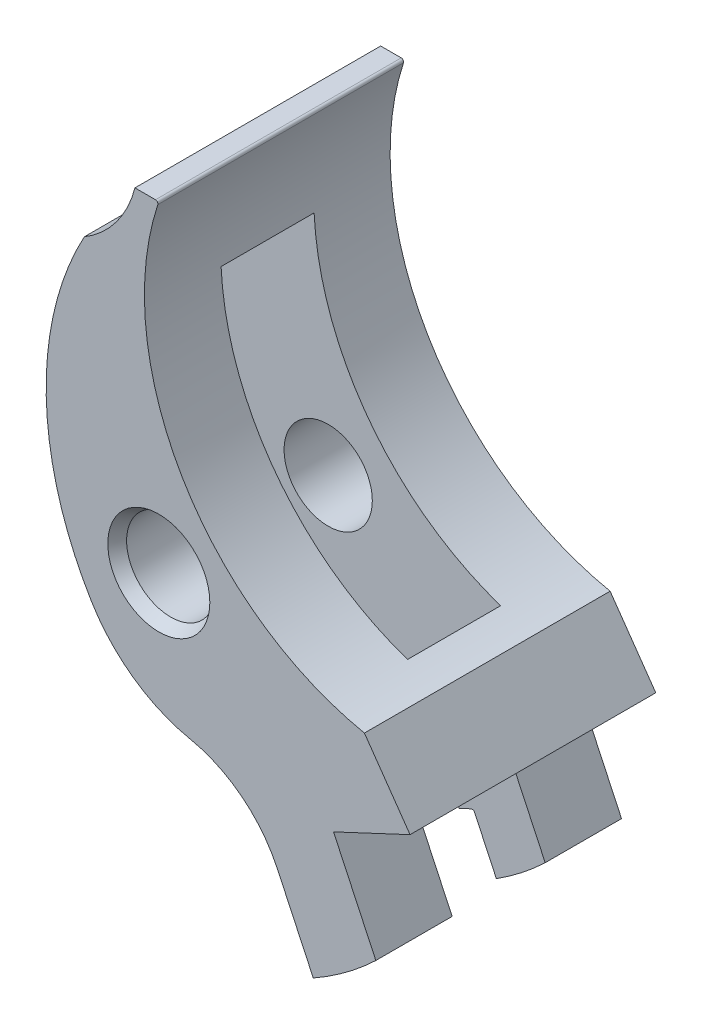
ISO-10303-21;
HEADER;
FILE_DESCRIPTION(('STEP AP214'),'2;1');
FILE_NAME('part.step','',(''),(''),'','','');
FILE_SCHEMA(('AUTOMOTIVE_DESIGN { 1 0 10303 214 1 1 1 1 }'));
ENDSEC;
DATA;
#1=APPLICATION_CONTEXT('core data for automotive mechanical design processes');
#2=APPLICATION_PROTOCOL_DEFINITION('international standard','automotive_design',2000,#1);
#3=PRODUCT_CONTEXT('',#1,'mechanical');
#4=PRODUCT('Part','Part','',(#3));
#5=PRODUCT_RELATED_PRODUCT_CATEGORY('part','',(#4));
#6=PRODUCT_DEFINITION_FORMATION('','',#4);
#7=PRODUCT_DEFINITION_CONTEXT('part definition',#1,'design');
#8=PRODUCT_DEFINITION('design','',#6,#7);
#9=PRODUCT_DEFINITION_SHAPE('','',#8);
#10=(LENGTH_UNIT() NAMED_UNIT(*) SI_UNIT(.MILLI.,.METRE.));
#11=(NAMED_UNIT(*) PLANE_ANGLE_UNIT() SI_UNIT($,.RADIAN.));
#12=(NAMED_UNIT(*) SI_UNIT($,.STERADIAN.) SOLID_ANGLE_UNIT());
#13=UNCERTAINTY_MEASURE_WITH_UNIT(LENGTH_MEASURE(1.E-05),#10,'distance_accuracy_value','');
#14=(GEOMETRIC_REPRESENTATION_CONTEXT(3) GLOBAL_UNCERTAINTY_ASSIGNED_CONTEXT((#13)) GLOBAL_UNIT_ASSIGNED_CONTEXT((#10,
#11,#12)) REPRESENTATION_CONTEXT('',''));
#15=CARTESIAN_POINT('',(0.,0.,0.));
#16=DIRECTION('',(0.,0.,1.));
#17=DIRECTION('',(1.,0.,0.));
#18=AXIS2_PLACEMENT_3D('',#15,#16,#17);
#19=CARTESIAN_POINT('',(0.,0.,3.9243));
#20=DIRECTION('',(0.,0.,1.));
#21=DIRECTION('',(1.,0.,0.));
#22=AXIS2_PLACEMENT_3D('',#19,#20,#21);
#23=PLANE('',#22);
#24=CARTESIAN_POINT('',(8.3281696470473,7.4676,3.9243));
#25=DIRECTION('',(0.,0.,-1.));
#26=DIRECTION('',(-1.,0.,0.));
#27=AXIS2_PLACEMENT_3D('',#24,#25,#26);
#28=CIRCLE('',#27,8.7884);
#29=CARTESIAN_POINT('',(6.56750446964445,-1.14262837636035,3.9243));
#30=VERTEX_POINT('',#29);
#31=CARTESIAN_POINT('',(-0.0329289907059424,10.1746286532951,3.9243));
#32=VERTEX_POINT('',#31);
#33=EDGE_CURVE('E435',#30,#32,#28,.T.);
#34=ORIENTED_EDGE('',*,*,#33,.T.);
#35=CARTESIAN_POINT('',(-0.105424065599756,10.1981,3.9243));
#36=DIRECTION('',(0.,0.,1.));
#37=DIRECTION('',(1.,0.,0.));
#38=AXIS2_PLACEMENT_3D('',#35,#36,#37);
#39=CIRCLE('',#38,0.0762);
#40=CARTESIAN_POINT('',(-0.105424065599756,10.2743,3.9243));
#41=VERTEX_POINT('',#40);
#42=EDGE_CURVE('E315',#32,#41,#39,.T.);
#43=ORIENTED_EDGE('',*,*,#42,.T.);
#44=DIRECTION('',(-1.,0.,0.));
#45=VECTOR('',#44,1.);
#46=CARTESIAN_POINT('',(0.,10.2743,3.9243));
#47=LINE('',#46,#45);
#48=CARTESIAN_POINT('',(-0.762,10.2743,3.9243));
#49=VERTEX_POINT('',#48);
#50=EDGE_CURVE('E438',#41,#49,#47,.T.);
#51=ORIENTED_EDGE('',*,*,#50,.T.);
#52=CARTESIAN_POINT('',(-4.20508219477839,11.1633,3.9243));
#53=DIRECTION('',(0.,0.,-1.));
#54=DIRECTION('',(-1.,0.,0.));
#55=AXIS2_PLACEMENT_3D('',#52,#53,#54);
#56=CIRCLE('',#55,3.556);
#57=CARTESIAN_POINT('',(-2.38002210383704,8.11136755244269,3.9243));
#58=VERTEX_POINT('',#57);
#59=EDGE_CURVE('E440',#49,#58,#56,.T.);
#60=ORIENTED_EDGE('',*,*,#59,.T.);
#61=CARTESIAN_POINT('',(6.40850243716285,3.32452160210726,3.9243));
#62=DIRECTION('',(0.,0.,1.));
#63=DIRECTION('',(1.,0.,0.));
#64=AXIS2_PLACEMENT_3D('',#61,#62,#63);
#65=CIRCLE('',#64,10.0076);
#66=CARTESIAN_POINT('',(-2.1433966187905,-1.87327411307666,3.9243));
#67=VERTEX_POINT('',#66);
#68=EDGE_CURVE('E442',#58,#67,#65,.T.);
#69=ORIENTED_EDGE('',*,*,#68,.T.);
#70=CARTESIAN_POINT('',(1.98061561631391,0.63327712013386,3.9243));
#71=DIRECTION('',(0.,0.,1.));
#72=DIRECTION('',(1.,0.,0.));
#73=AXIS2_PLACEMENT_3D('',#70,#71,#72);
#74=CIRCLE('',#73,4.826);
#75=CARTESIAN_POINT('',(1.00319933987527,-4.09270779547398,3.9243));
#76=VERTEX_POINT('',#75);
#77=EDGE_CURVE('E444',#67,#76,#74,.T.);
#78=ORIENTED_EDGE('',*,*,#77,.T.);
#79=CARTESIAN_POINT('',(0.200689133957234,-7.9729901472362,3.9243));
#80=DIRECTION('',(0.,0.,-1.));
#81=DIRECTION('',(-1.,0.,0.));
#82=AXIS2_PLACEMENT_3D('',#79,#80,#81);
#83=CIRCLE('',#82,3.9624);
#84=CARTESIAN_POINT('',(3.78891494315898,-6.29214235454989,3.9243));
#85=VERTEX_POINT('',#84);
#86=EDGE_CURVE('E247',#76,#85,#83,.T.);
#87=ORIENTED_EDGE('',*,*,#86,.T.);
#88=DIRECTION('',(0.424199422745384,-0.905568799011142,0.));
#89=VECTOR('',#88,1.);
#90=CARTESIAN_POINT('',(4.93374354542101,-8.73608972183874,3.9243));
#91=LINE('',#90,#89);
#92=CARTESIAN_POINT('',(4.93374354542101,-8.73608972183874,3.9243));
#93=VERTEX_POINT('',#92);
#94=EDGE_CURVE('E243',#85,#93,#91,.T.);
#95=ORIENTED_EDGE('',*,*,#94,.T.);
#96=CARTESIAN_POINT('',(0.,0.,3.9243));
#97=DIRECTION('',(0.,0.,1.));
#98=DIRECTION('',(1.,0.,0.));
#99=AXIS2_PLACEMENT_3D('',#96,#97,#98);
#100=CIRCLE('',#99,10.033);
#101=CARTESIAN_POINT('',(6.93183776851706,-7.25332435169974,3.9243));
#102=VERTEX_POINT('',#101);
#103=EDGE_CURVE('E426',#93,#102,#100,.T.);
#104=ORIENTED_EDGE('',*,*,#103,.T.);
#105=DIRECTION('',(-0.424199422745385,0.905568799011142,0.));
#106=VECTOR('',#105,1.);
#107=CARTESIAN_POINT('',(6.93183776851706,-7.25332435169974,3.9243));
#108=LINE('',#107,#106);
#109=CARTESIAN_POINT('',(5.58107405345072,-4.36975259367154,3.9243));
#110=VERTEX_POINT('',#109);
#111=EDGE_CURVE('E429',#102,#110,#108,.T.);
#112=ORIENTED_EDGE('',*,*,#111,.T.);
#113=DIRECTION('',(0.905568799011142,0.424199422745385,0.));
#114=VECTOR('',#113,1.);
#115=CARTESIAN_POINT('',(5.58107405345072,-4.36975259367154,3.9243));
#116=LINE('',#115,#114);
#117=CARTESIAN_POINT('',(8.02541459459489,-3.22473981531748,3.9243));
#118=VERTEX_POINT('',#117);
#119=EDGE_CURVE('E431',#110,#118,#116,.T.);
#120=ORIENTED_EDGE('',*,*,#119,.T.);
#121=DIRECTION('',(-0.573576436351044,0.819152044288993,0.));
#122=VECTOR('',#121,1.);
#123=CARTESIAN_POINT('',(8.02541459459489,-3.22473981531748,3.9243));
#124=LINE('',#123,#122);
#125=EDGE_CURVE('E433',#118,#30,#124,.T.);
#126=ORIENTED_EDGE('',*,*,#125,.T.);
#127=EDGE_LOOP('',(#34,#43,#51,#60,#69,#78,#87,#95,#104,#112,#120,#126));
#128=FACE_BOUND('',#127,.T.);
#129=CARTESIAN_POINT('',(0.,0.,3.9243));
#130=DIRECTION('',(0.,0.,1.));
#131=DIRECTION('',(1.,0.,0.));
#132=AXIS2_PLACEMENT_3D('',#129,#130,#131);
#133=CIRCLE('',#132,1.62967045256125);
#134=CARTESIAN_POINT('',(1.62967045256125,0.,3.9243));
#135=VERTEX_POINT('',#134);
#136=EDGE_CURVE('E298',#135,#135,#133,.T.);
#137=ORIENTED_EDGE('',*,*,#136,.F.);
#138=EDGE_LOOP('',(#137));
#139=FACE_BOUND('',#138,.T.);
#140=ADVANCED_FACE('F32',(#128,#139),#23,.T.);
#141=CARTESIAN_POINT('',(0.,0.,3.9243));
#142=DIRECTION('',(0.,0.,-1.));
#143=DIRECTION('',(-1.,0.,0.));
#144=AXIS2_PLACEMENT_3D('',#141,#142,#143);
#145=CYLINDRICAL_SURFACE('',#144,1.4097);
#146=CARTESIAN_POINT('',(0.,0.,1.4859));
#147=DIRECTION('',(0.,0.,1.));
#148=DIRECTION('',(1.,0.,0.));
#149=AXIS2_PLACEMENT_3D('',#146,#147,#148);
#150=CIRCLE('',#149,1.4097);
#151=CARTESIAN_POINT('',(1.4097,0.,1.4859));
#152=VERTEX_POINT('',#151);
#153=EDGE_CURVE('E284',#152,#152,#150,.T.);
#154=ORIENTED_EDGE('',*,*,#153,.F.);
#155=EDGE_LOOP('',(#154));
#156=FACE_BOUND('',#155,.T.);
#157=CARTESIAN_POINT('',(0.,0.,3.5433));
#158=DIRECTION('',(0.,0.,1.));
#159=DIRECTION('',(1.,0.,0.));
#160=AXIS2_PLACEMENT_3D('',#157,#158,#159);
#161=CIRCLE('',#160,1.4097);
#162=CARTESIAN_POINT('',(1.4097,0.,3.5433));
#163=VERTEX_POINT('',#162);
#164=EDGE_CURVE('E294',#163,#163,#161,.T.);
#165=ORIENTED_EDGE('',*,*,#164,.T.);
#166=EDGE_LOOP('',(#165));
#167=FACE_BOUND('',#166,.T.);
#168=ADVANCED_FACE('F573',(#156,#167),#145,.F.);
#169=CARTESIAN_POINT('',(0.,0.,-1.4859));
#170=DIRECTION('',(0.,0.,1.));
#171=DIRECTION('',(1.,0.,0.));
#172=AXIS2_PLACEMENT_3D('',#169,#170,#171);
#173=CIRCLE('',#172,1.4097);
#174=CARTESIAN_POINT('',(1.4097,0.,-1.4859));
#175=VERTEX_POINT('',#174);
#176=EDGE_CURVE('E289',#175,#175,#173,.T.);
#177=ORIENTED_EDGE('',*,*,#176,.T.);
#178=EDGE_LOOP('',(#177));
#179=FACE_BOUND('',#178,.T.);
#180=CARTESIAN_POINT('',(0.,0.,-3.5433));
#181=DIRECTION('',(0.,0.,-1.));
#182=DIRECTION('',(-1.,0.,0.));
#183=AXIS2_PLACEMENT_3D('',#180,#181,#182);
#184=CIRCLE('',#183,1.4097);
#185=CARTESIAN_POINT('',(-1.4097,0.,-3.5433));
#186=VERTEX_POINT('',#185);
#187=EDGE_CURVE('E361',#186,#186,#184,.T.);
#188=ORIENTED_EDGE('',*,*,#187,.T.);
#189=EDGE_LOOP('',(#188));
#190=FACE_BOUND('',#189,.T.);
#191=ADVANCED_FACE('F578',(#179,#190),#145,.F.);
#192=CARTESIAN_POINT('',(0.,0.,-3.9243));
#193=DIRECTION('',(0.,0.,1.));
#194=DIRECTION('',(1.,0.,0.));
#195=AXIS2_PLACEMENT_3D('',#192,#193,#194);
#196=PLANE('',#195);
#197=DIRECTION('',(-1.,0.,0.));
#198=VECTOR('',#197,1.);
#199=CARTESIAN_POINT('',(0.,10.2743,-3.9243));
#200=LINE('',#199,#198);
#201=CARTESIAN_POINT('',(-0.105424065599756,10.2743,-3.9243));
#202=VERTEX_POINT('',#201);
#203=CARTESIAN_POINT('',(-0.762,10.2743,-3.9243));
#204=VERTEX_POINT('',#203);
#205=EDGE_CURVE('E458',#202,#204,#200,.T.);
#206=ORIENTED_EDGE('',*,*,#205,.F.);
#207=CARTESIAN_POINT('',(-0.105424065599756,10.1981,-3.9243));
#208=DIRECTION('',(0.,0.,1.));
#209=DIRECTION('',(1.,0.,0.));
#210=AXIS2_PLACEMENT_3D('',#207,#208,#209);
#211=CIRCLE('',#210,0.0762);
#212=CARTESIAN_POINT('',(-0.0329289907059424,10.1746286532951,-3.9243));
#213=VERTEX_POINT('',#212);
#214=EDGE_CURVE('E311',#202,#213,#211,.F.);
#215=ORIENTED_EDGE('',*,*,#214,.T.);
#216=CARTESIAN_POINT('',(8.3281696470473,7.4676,-3.9243));
#217=DIRECTION('',(0.,0.,-1.));
#218=DIRECTION('',(-1.,0.,0.));
#219=AXIS2_PLACEMENT_3D('',#216,#217,#218);
#220=CIRCLE('',#219,8.7884);
#221=CARTESIAN_POINT('',(6.56750446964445,-1.14262837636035,-3.9243));
#222=VERTEX_POINT('',#221);
#223=EDGE_CURVE('E455',#222,#213,#220,.T.);
#224=ORIENTED_EDGE('',*,*,#223,.F.);
#225=DIRECTION('',(-0.573576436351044,0.819152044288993,0.));
#226=VECTOR('',#225,1.);
#227=CARTESIAN_POINT('',(8.02541459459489,-3.22473981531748,-3.9243));
#228=LINE('',#227,#226);
#229=CARTESIAN_POINT('',(8.02541459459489,-3.22473981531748,-3.9243));
#230=VERTEX_POINT('',#229);
#231=EDGE_CURVE('E453',#230,#222,#228,.T.);
#232=ORIENTED_EDGE('',*,*,#231,.F.);
#233=DIRECTION('',(0.905568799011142,0.424199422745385,0.));
#234=VECTOR('',#233,1.);
#235=CARTESIAN_POINT('',(5.58107405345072,-4.36975259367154,-3.9243));
#236=LINE('',#235,#234);
#237=CARTESIAN_POINT('',(5.58107405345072,-4.36975259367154,-3.9243));
#238=VERTEX_POINT('',#237);
#239=EDGE_CURVE('E451',#238,#230,#236,.T.);
#240=ORIENTED_EDGE('',*,*,#239,.F.);
#241=DIRECTION('',(-0.424199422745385,0.905568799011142,0.));
#242=VECTOR('',#241,1.);
#243=CARTESIAN_POINT('',(6.93183776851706,-7.25332435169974,-3.9243));
#244=LINE('',#243,#242);
#245=CARTESIAN_POINT('',(6.93183776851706,-7.25332435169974,-3.9243));
#246=VERTEX_POINT('',#245);
#247=EDGE_CURVE('E448',#246,#238,#244,.T.);
#248=ORIENTED_EDGE('',*,*,#247,.F.);
#249=CARTESIAN_POINT('',(0.,0.,-3.9243));
#250=DIRECTION('',(0.,0.,1.));
#251=DIRECTION('',(1.,0.,0.));
#252=AXIS2_PLACEMENT_3D('',#249,#250,#251);
#253=CIRCLE('',#252,10.033);
#254=CARTESIAN_POINT('',(4.93374354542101,-8.73608972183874,-3.9243));
#255=VERTEX_POINT('',#254);
#256=EDGE_CURVE('E425',#255,#246,#253,.T.);
#257=ORIENTED_EDGE('',*,*,#256,.F.);
#258=DIRECTION('',(0.424199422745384,-0.905568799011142,0.));
#259=VECTOR('',#258,1.);
#260=CARTESIAN_POINT('',(4.93374354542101,-8.73608972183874,-3.9243));
#261=LINE('',#260,#259);
#262=CARTESIAN_POINT('',(3.78891494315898,-6.29214235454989,-3.9243));
#263=VERTEX_POINT('',#262);
#264=EDGE_CURVE('E240',#263,#255,#261,.T.);
#265=ORIENTED_EDGE('',*,*,#264,.F.);
#266=CARTESIAN_POINT('',(0.200689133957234,-7.9729901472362,-3.9243));
#267=DIRECTION('',(0.,0.,-1.));
#268=DIRECTION('',(-1.,0.,0.));
#269=AXIS2_PLACEMENT_3D('',#266,#267,#268);
#270=CIRCLE('',#269,3.9624);
#271=CARTESIAN_POINT('',(1.00319933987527,-4.09270779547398,-3.9243));
#272=VERTEX_POINT('',#271);
#273=EDGE_CURVE('E467',#272,#263,#270,.T.);
#274=ORIENTED_EDGE('',*,*,#273,.F.);
#275=CARTESIAN_POINT('',(1.98061561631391,0.63327712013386,-3.9243));
#276=DIRECTION('',(0.,0.,1.));
#277=DIRECTION('',(1.,0.,0.));
#278=AXIS2_PLACEMENT_3D('',#275,#276,#277);
#279=CIRCLE('',#278,4.826);
#280=CARTESIAN_POINT('',(-2.1433966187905,-1.87327411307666,-3.9243));
#281=VERTEX_POINT('',#280);
#282=EDGE_CURVE('E465',#281,#272,#279,.T.);
#283=ORIENTED_EDGE('',*,*,#282,.F.);
#284=CARTESIAN_POINT('',(6.40850243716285,3.32452160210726,-3.9243));
#285=DIRECTION('',(0.,0.,1.));
#286=DIRECTION('',(1.,0.,0.));
#287=AXIS2_PLACEMENT_3D('',#284,#285,#286);
#288=CIRCLE('',#287,10.0076);
#289=CARTESIAN_POINT('',(-2.38002210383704,8.11136755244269,-3.9243));
#290=VERTEX_POINT('',#289);
#291=EDGE_CURVE('E462',#290,#281,#288,.T.);
#292=ORIENTED_EDGE('',*,*,#291,.F.);
#293=CARTESIAN_POINT('',(-4.20508219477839,11.1633,-3.9243));
#294=DIRECTION('',(0.,0.,-1.));
#295=DIRECTION('',(-1.,0.,0.));
#296=AXIS2_PLACEMENT_3D('',#293,#294,#295);
#297=CIRCLE('',#296,3.556);
#298=EDGE_CURVE('E460',#204,#290,#297,.T.);
#299=ORIENTED_EDGE('',*,*,#298,.F.);
#300=EDGE_LOOP('',(#206,#215,#224,#232,#240,#248,#257,#265,#274,#283,#292,#299));
#301=FACE_BOUND('',#300,.T.);
#302=CARTESIAN_POINT('',(0.,0.,-3.9243));
#303=DIRECTION('',(0.,0.,1.));
#304=DIRECTION('',(1.,0.,0.));
#305=AXIS2_PLACEMENT_3D('',#302,#303,#304);
#306=CIRCLE('',#305,1.62967045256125);
#307=CARTESIAN_POINT('',(1.62967045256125,0.,-3.9243));
#308=VERTEX_POINT('',#307);
#309=EDGE_CURVE('E297',#308,#308,#306,.T.);
#310=ORIENTED_EDGE('',*,*,#309,.T.);
#311=EDGE_LOOP('',(#310));
#312=FACE_BOUND('',#311,.T.);
#313=ADVANCED_FACE('F478',(#301,#312),#196,.F.);
#314=CARTESIAN_POINT('',(0.,0.,3.9243));
#315=DIRECTION('',(0.,0.,-1.));
#316=DIRECTION('',(-1.,0.,0.));
#317=AXIS2_PLACEMENT_3D('',#314,#315,#316);
#318=CYLINDRICAL_SURFACE('',#317,10.033);
#319=CARTESIAN_POINT('',(0.,0.,-1.4859));
#320=DIRECTION('',(0.,0.,1.));
#321=DIRECTION('',(1.,0.,0.));
#322=AXIS2_PLACEMENT_3D('',#319,#320,#321);
#323=CIRCLE('',#322,10.033);
#324=CARTESIAN_POINT('',(5.3718304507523,-8.47375516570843,-1.4859));
#325=VERTEX_POINT('',#324);
#326=CARTESIAN_POINT('',(6.93183776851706,-7.25332435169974,-1.4859));
#327=VERTEX_POINT('',#326);
#328=EDGE_CURVE('E235',#325,#327,#323,.T.);
#329=ORIENTED_EDGE('',*,*,#328,.F.);
#330=CARTESIAN_POINT('',(0.,0.,-2.75589999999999));
#331=DIRECTION('',(0.640333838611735,0.29995428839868,-0.707106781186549));
#332=DIRECTION('',(-0.640333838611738,-0.299954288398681,-0.707106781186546));
#333=AXIS2_PLACEMENT_3D('',#330,#331,#332);
#334=ELLIPSE('',#333,14.1888046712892,10.033);
#335=CARTESIAN_POINT('',(4.93374354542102,-8.73608972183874,-1.9939));
#336=VERTEX_POINT('',#335);
#337=EDGE_CURVE('E222',#325,#336,#334,.T.);
#338=ORIENTED_EDGE('',*,*,#337,.T.);
#339=DIRECTION('',(0.,0.,-1.));
#340=VECTOR('',#339,1.);
#341=CARTESIAN_POINT('',(4.93374354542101,-8.73608972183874,3.9243));
#342=LINE('',#341,#340);
#343=EDGE_CURVE('E232',#336,#255,#342,.T.);
#344=ORIENTED_EDGE('',*,*,#343,.T.);
#345=ORIENTED_EDGE('',*,*,#256,.T.);
#346=DIRECTION('',(0.,0.,-1.));
#347=VECTOR('',#346,1.);
#348=CARTESIAN_POINT('',(6.93183776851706,-7.25332435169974,3.9243));
#349=LINE('',#348,#347);
#350=EDGE_CURVE('E279',#327,#246,#349,.T.);
#351=ORIENTED_EDGE('',*,*,#350,.F.);
#352=EDGE_LOOP('',(#329,#338,#344,#345,#351));
#353=FACE_BOUND('',#352,.T.);
#354=ADVANCED_FACE('F230',(#353),#318,.T.);
#355=CARTESIAN_POINT('',(6.93183776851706,-7.25332435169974,3.9243));
#356=DIRECTION('',(-0.905568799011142,-0.424199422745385,0.));
#357=DIRECTION('',(0.424199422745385,-0.905568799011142,0.));
#358=AXIS2_PLACEMENT_3D('',#355,#356,#357);
#359=PLANE('',#358);
#360=DIRECTION('',(-0.424199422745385,0.905568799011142,0.));
#361=VECTOR('',#360,1.);
#362=CARTESIAN_POINT('',(6.93183776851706,-7.25332435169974,-1.4859));
#363=LINE('',#362,#361);
#364=CARTESIAN_POINT('',(5.58107405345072,-4.36975259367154,-1.4859));
#365=VERTEX_POINT('',#364);
#366=EDGE_CURVE('E413',#327,#365,#363,.T.);
#367=ORIENTED_EDGE('',*,*,#366,.F.);
#368=ORIENTED_EDGE('',*,*,#350,.T.);
#369=ORIENTED_EDGE('',*,*,#247,.T.);
#370=DIRECTION('',(0.,0.,-1.));
#371=VECTOR('',#370,1.);
#372=CARTESIAN_POINT('',(5.58107405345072,-4.36975259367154,3.9243));
#373=LINE('',#372,#371);
#374=EDGE_CURVE('E275',#365,#238,#373,.T.);
#375=ORIENTED_EDGE('',*,*,#374,.F.);
#376=EDGE_LOOP('',(#367,#368,#369,#375));
#377=FACE_BOUND('',#376,.T.);
#378=ADVANCED_FACE('F484',(#377),#359,.F.);
#379=CARTESIAN_POINT('',(5.58107405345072,-4.36975259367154,3.9243));
#380=DIRECTION('',(-0.424199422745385,0.905568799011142,0.));
#381=DIRECTION('',(-0.905568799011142,-0.424199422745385,0.));
#382=AXIS2_PLACEMENT_3D('',#379,#380,#381);
#383=PLANE('',#382);
#384=DIRECTION('',(0.905568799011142,0.424199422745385,0.));
#385=VECTOR('',#384,1.);
#386=CARTESIAN_POINT('',(5.58107405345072,-4.36975259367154,-1.4859));
#387=LINE('',#386,#385);
#388=CARTESIAN_POINT('',(6.1574840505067,-4.09974242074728,-1.4859));
#389=VERTEX_POINT('',#388);
#390=EDGE_CURVE('E415',#365,#389,#387,.T.);
#391=ORIENTED_EDGE('',*,*,#390,.F.);
#392=ORIENTED_EDGE('',*,*,#374,.T.);
#393=ORIENTED_EDGE('',*,*,#239,.T.);
#394=DIRECTION('',(0.,0.,-1.));
#395=VECTOR('',#394,1.);
#396=CARTESIAN_POINT('',(8.02541459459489,-3.22473981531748,3.9243));
#397=LINE('',#396,#395);
#398=EDGE_CURVE('E272',#118,#230,#397,.T.);
#399=ORIENTED_EDGE('',*,*,#398,.F.);
#400=ORIENTED_EDGE('',*,*,#119,.F.);
#401=CARTESIAN_POINT('',(5.58107405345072,-4.36975259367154,1.4859));
#402=VERTEX_POINT('',#401);
#403=EDGE_CURVE('E276',#110,#402,#373,.T.);
#404=ORIENTED_EDGE('',*,*,#403,.T.);
#405=DIRECTION('',(0.905568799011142,0.424199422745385,0.));
#406=VECTOR('',#405,1.);
#407=CARTESIAN_POINT('',(5.58107405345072,-4.36975259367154,1.4859));
#408=LINE('',#407,#406);
#409=CARTESIAN_POINT('',(6.1574840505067,-4.09974242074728,1.4859));
#410=VERTEX_POINT('',#409);
#411=EDGE_CURVE('E399',#402,#410,#408,.T.);
#412=ORIENTED_EDGE('',*,*,#411,.T.);
#413=DIRECTION('',(0.,0.,1.));
#414=VECTOR('',#413,1.);
#415=CARTESIAN_POINT('',(6.1574840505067,-4.09974242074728,-1.4859));
#416=LINE('',#415,#414);
#417=EDGE_CURVE('E380',#389,#410,#416,.T.);
#418=ORIENTED_EDGE('',*,*,#417,.F.);
#419=EDGE_LOOP('',(#391,#392,#393,#399,#400,#404,#412,#418));
#420=FACE_BOUND('',#419,.T.);
#421=ADVANCED_FACE('F492',(#420),#383,.F.);
#422=CARTESIAN_POINT('',(8.3281696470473,7.4676,3.9243));
#423=DIRECTION('',(0.,0.,-1.));
#424=DIRECTION('',(-1.,0.,0.));
#425=AXIS2_PLACEMENT_3D('',#422,#423,#424);
#426=CYLINDRICAL_SURFACE('',#425,8.7884);
#427=ORIENTED_EDGE('',*,*,#223,.T.);
#428=DIRECTION('',(0.,0.,-1.));
#429=VECTOR('',#428,1.);
#430=CARTESIAN_POINT('',(-0.0329289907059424,10.1746286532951,3.9243));
#431=LINE('',#430,#429);
#432=EDGE_CURVE('E313',#213,#32,#431,.F.);
#433=ORIENTED_EDGE('',*,*,#432,.T.);
#434=ORIENTED_EDGE('',*,*,#33,.F.);
#435=DIRECTION('',(0.,0.,-1.));
#436=VECTOR('',#435,1.);
#437=CARTESIAN_POINT('',(6.56750446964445,-1.14262837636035,3.9243));
#438=LINE('',#437,#436);
#439=EDGE_CURVE('E269',#30,#222,#438,.T.);
#440=ORIENTED_EDGE('',*,*,#439,.T.);
#441=EDGE_LOOP('',(#427,#433,#434,#440));
#442=FACE_BOUND('',#441,.T.);
#443=CARTESIAN_POINT('',(8.3281696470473,7.4676,-1.4859));
#444=DIRECTION('',(0.,0.,1.));
#445=DIRECTION('',(1.,0.,0.));
#446=AXIS2_PLACEMENT_3D('',#443,#444,#445);
#447=CIRCLE('',#446,8.7884);
#448=CARTESIAN_POINT('',(5.50760667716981,-0.855884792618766,-1.4859));
#449=VERTEX_POINT('',#448);
#450=CARTESIAN_POINT('',(-0.449510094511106,7.03364964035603,-1.4859));
#451=VERTEX_POINT('',#450);
#452=EDGE_CURVE('E417',#449,#451,#447,.F.);
#453=ORIENTED_EDGE('',*,*,#452,.F.);
#454=DIRECTION('',(0.,0.,1.));
#455=VECTOR('',#454,1.);
#456=CARTESIAN_POINT('',(5.50760667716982,-0.855884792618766,0.));
#457=LINE('',#456,#455);
#458=CARTESIAN_POINT('',(5.50760667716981,-0.855884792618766,1.4859));
#459=VERTEX_POINT('',#458);
#460=EDGE_CURVE('E419',#449,#459,#457,.T.);
#461=ORIENTED_EDGE('',*,*,#460,.T.);
#462=CARTESIAN_POINT('',(8.3281696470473,7.4676,1.4859));
#463=DIRECTION('',(0.,0.,1.));
#464=DIRECTION('',(1.,0.,0.));
#465=AXIS2_PLACEMENT_3D('',#462,#463,#464);
#466=CIRCLE('',#465,8.7884);
#467=CARTESIAN_POINT('',(-0.449510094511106,7.03364964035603,1.4859));
#468=VERTEX_POINT('',#467);
#469=EDGE_CURVE('E293',#459,#468,#466,.F.);
#470=ORIENTED_EDGE('',*,*,#469,.T.);
#471=DIRECTION('',(0.,0.,1.));
#472=VECTOR('',#471,1.);
#473=CARTESIAN_POINT('',(-0.449510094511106,7.03364964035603,0.));
#474=LINE('',#473,#472);
#475=EDGE_CURVE('E422',#468,#451,#474,.F.);
#476=ORIENTED_EDGE('',*,*,#475,.T.);
#477=EDGE_LOOP('',(#453,#461,#470,#476));
#478=FACE_BOUND('',#477,.T.);
#479=ADVANCED_FACE('F503',(#442,#478),#426,.F.);
#480=CARTESIAN_POINT('',(6.40850243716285,3.32452160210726,3.9243));
#481=DIRECTION('',(0.,0.,-1.));
#482=DIRECTION('',(-1.,0.,0.));
#483=AXIS2_PLACEMENT_3D('',#480,#481,#482);
#484=CYLINDRICAL_SURFACE('',#483,10.0076);
#485=CARTESIAN_POINT('',(6.40850243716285,3.32452160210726,-1.4859));
#486=DIRECTION('',(0.,0.,1.));
#487=DIRECTION('',(1.,0.,0.));
#488=AXIS2_PLACEMENT_3D('',#485,#486,#487);
#489=CIRCLE('',#488,10.0076);
#490=CARTESIAN_POINT('',(-2.43497888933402,8.00905955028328,-1.4859));
#491=VERTEX_POINT('',#490);
#492=CARTESIAN_POINT('',(-2.1433966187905,-1.87327411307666,-1.4859));
#493=VERTEX_POINT('',#492);
#494=EDGE_CURVE('E410',#491,#493,#489,.T.);
#495=ORIENTED_EDGE('',*,*,#494,.F.);
#496=DIRECTION('',(0.,0.,1.));
#497=VECTOR('',#496,1.);
#498=CARTESIAN_POINT('',(-2.43497888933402,8.00905955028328,-1.4859));
#499=LINE('',#498,#497);
#500=CARTESIAN_POINT('',(-2.43497888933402,8.00905955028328,1.4859));
#501=VERTEX_POINT('',#500);
#502=EDGE_CURVE('E372',#491,#501,#499,.T.);
#503=ORIENTED_EDGE('',*,*,#502,.T.);
#504=CARTESIAN_POINT('',(6.40850243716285,3.32452160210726,1.4859));
#505=DIRECTION('',(0.,0.,1.));
#506=DIRECTION('',(1.,0.,0.));
#507=AXIS2_PLACEMENT_3D('',#504,#505,#506);
#508=CIRCLE('',#507,10.0076);
#509=CARTESIAN_POINT('',(-2.1433966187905,-1.87327411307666,1.4859));
#510=VERTEX_POINT('',#509);
#511=EDGE_CURVE('E391',#501,#510,#508,.T.);
#512=ORIENTED_EDGE('',*,*,#511,.T.);
#513=DIRECTION('',(0.,0.,-1.));
#514=VECTOR('',#513,1.);
#515=CARTESIAN_POINT('',(-2.1433966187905,-1.87327411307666,3.9243));
#516=LINE('',#515,#514);
#517=EDGE_CURVE('E260',#67,#510,#516,.T.);
#518=ORIENTED_EDGE('',*,*,#517,.F.);
#519=ORIENTED_EDGE('',*,*,#68,.F.);
#520=DIRECTION('',(0.,0.,-1.));
#521=VECTOR('',#520,1.);
#522=CARTESIAN_POINT('',(-2.38002210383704,8.11136755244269,3.9243));
#523=LINE('',#522,#521);
#524=EDGE_CURVE('E263',#58,#290,#523,.T.);
#525=ORIENTED_EDGE('',*,*,#524,.T.);
#526=ORIENTED_EDGE('',*,*,#291,.T.);
#527=EDGE_CURVE('E259',#493,#281,#516,.T.);
#528=ORIENTED_EDGE('',*,*,#527,.F.);
#529=EDGE_LOOP('',(#495,#503,#512,#518,#519,#525,#526,#528));
#530=FACE_BOUND('',#529,.T.);
#531=ADVANCED_FACE('F513',(#530),#484,.T.);
#532=CARTESIAN_POINT('',(1.98061561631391,0.63327712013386,3.9243));
#533=DIRECTION('',(0.,0.,-1.));
#534=DIRECTION('',(-1.,0.,0.));
#535=AXIS2_PLACEMENT_3D('',#532,#533,#534);
#536=CYLINDRICAL_SURFACE('',#535,4.826);
#537=CARTESIAN_POINT('',(1.98061561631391,0.63327712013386,-1.4859));
#538=DIRECTION('',(0.,0.,1.));
#539=DIRECTION('',(1.,0.,0.));
#540=AXIS2_PLACEMENT_3D('',#537,#538,#539);
#541=CIRCLE('',#540,4.826);
#542=CARTESIAN_POINT('',(1.00319933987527,-4.09270779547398,-1.4859));
#543=VERTEX_POINT('',#542);
#544=EDGE_CURVE('E408',#493,#543,#541,.T.);
#545=ORIENTED_EDGE('',*,*,#544,.F.);
#546=ORIENTED_EDGE('',*,*,#527,.T.);
#547=ORIENTED_EDGE('',*,*,#282,.T.);
#548=DIRECTION('',(0.,0.,-1.));
#549=VECTOR('',#548,1.);
#550=CARTESIAN_POINT('',(1.00319933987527,-4.09270779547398,3.9243));
#551=LINE('',#550,#549);
#552=EDGE_CURVE('E255',#543,#272,#551,.T.);
#553=ORIENTED_EDGE('',*,*,#552,.F.);
#554=EDGE_LOOP('',(#545,#546,#547,#553));
#555=FACE_BOUND('',#554,.T.);
#556=ADVANCED_FACE('F516',(#555),#536,.T.);
#557=CARTESIAN_POINT('',(0.200689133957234,-7.9729901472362,3.9243));
#558=DIRECTION('',(0.,0.,-1.));
#559=DIRECTION('',(-1.,0.,0.));
#560=AXIS2_PLACEMENT_3D('',#557,#558,#559);
#561=CYLINDRICAL_SURFACE('',#560,3.9624);
#562=CARTESIAN_POINT('',(0.200689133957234,-7.9729901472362,-1.4859));
#563=DIRECTION('',(0.,0.,1.));
#564=DIRECTION('',(1.,0.,0.));
#565=AXIS2_PLACEMENT_3D('',#562,#563,#564);
#566=CIRCLE('',#565,3.9624);
#567=CARTESIAN_POINT('',(3.78891494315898,-6.29214235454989,-1.4859));
#568=VERTEX_POINT('',#567);
#569=EDGE_CURVE('E406',#543,#568,#566,.F.);
#570=ORIENTED_EDGE('',*,*,#569,.F.);
#571=ORIENTED_EDGE('',*,*,#552,.T.);
#572=ORIENTED_EDGE('',*,*,#273,.T.);
#573=DIRECTION('',(0.,0.,-1.));
#574=VECTOR('',#573,1.);
#575=CARTESIAN_POINT('',(3.78891494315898,-6.29214235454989,3.9243));
#576=LINE('',#575,#574);
#577=EDGE_CURVE('E246',#568,#263,#576,.T.);
#578=ORIENTED_EDGE('',*,*,#577,.F.);
#579=EDGE_LOOP('',(#570,#571,#572,#578));
#580=FACE_BOUND('',#579,.T.);
#581=ADVANCED_FACE('F473',(#580),#561,.F.);
#582=CARTESIAN_POINT('',(4.93374354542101,-8.73608972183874,3.9243));
#583=DIRECTION('',(0.905568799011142,0.424199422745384,0.));
#584=DIRECTION('',(-0.424199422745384,0.905568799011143,0.));
#585=AXIS2_PLACEMENT_3D('',#582,#583,#584);
#586=PLANE('',#585);
#587=ORIENTED_EDGE('',*,*,#343,.F.);
#588=DIRECTION('',(0.424199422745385,-0.905568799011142,0.));
#589=VECTOR('',#588,1.);
#590=CARTESIAN_POINT('',(4.17951697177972,-7.12598839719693,-1.9939));
#591=LINE('',#590,#589);
#592=CARTESIAN_POINT('',(4.21184096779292,-7.19499273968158,-1.9939));
#593=VERTEX_POINT('',#592);
#594=EDGE_CURVE('E219',#593,#336,#591,.T.);
#595=ORIENTED_EDGE('',*,*,#594,.F.);
#596=CARTESIAN_POINT('',(4.21184096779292,-7.19499273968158,-1.88613692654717));
#597=DIRECTION('',(0.905568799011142,0.424199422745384,0.));
#598=DIRECTION('',(0.,0.,1.));
#599=AXIS2_PLACEMENT_3D('',#596,#597,#598);
#600=ELLIPSE('',#599,0.10776307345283,0.0762);
#601=CARTESIAN_POINT('',(4.17951697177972,-7.12598839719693,-1.88613692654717));
#602=VERTEX_POINT('',#601);
#603=EDGE_CURVE('E11',#593,#602,#600,.T.);
#604=ORIENTED_EDGE('',*,*,#603,.T.);
#605=DIRECTION('',(0.,0.,-1.));
#606=VECTOR('',#605,1.);
#607=CARTESIAN_POINT('',(4.17951697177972,-7.12598839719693,3.9243));
#608=LINE('',#607,#606);
#609=CARTESIAN_POINT('',(4.17951697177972,-7.12598839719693,-1.4859));
#610=VERTEX_POINT('',#609);
#611=EDGE_CURVE('E226',#610,#602,#608,.T.);
#612=ORIENTED_EDGE('',*,*,#611,.F.);
#613=DIRECTION('',(0.424199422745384,-0.905568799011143,0.));
#614=VECTOR('',#613,1.);
#615=CARTESIAN_POINT('',(4.93374354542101,-8.73608972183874,-1.4859));
#616=LINE('',#615,#614);
#617=EDGE_CURVE('E292',#568,#610,#616,.T.);
#618=ORIENTED_EDGE('',*,*,#617,.F.);
#619=ORIENTED_EDGE('',*,*,#577,.T.);
#620=ORIENTED_EDGE('',*,*,#264,.T.);
#621=EDGE_LOOP('',(#587,#595,#604,#612,#618,#619,#620));
#622=FACE_BOUND('',#621,.T.);
#623=ADVANCED_FACE('F238',(#622),#586,.F.);
#624=CARTESIAN_POINT('',(4.93374354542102,-8.73608972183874,1.9939));
#625=VERTEX_POINT('',#624);
#626=EDGE_CURVE('E242',#93,#625,#342,.T.);
#627=ORIENTED_EDGE('',*,*,#626,.T.);
#628=CARTESIAN_POINT('',(0.,0.,2.7559));
#629=DIRECTION('',(0.640333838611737,0.299954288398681,0.707106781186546));
#630=DIRECTION('',(0.640333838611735,0.29995428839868,-0.707106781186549));
#631=AXIS2_PLACEMENT_3D('',#628,#629,#630);
#632=ELLIPSE('',#631,14.1888046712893,10.033);
#633=CARTESIAN_POINT('',(5.3718304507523,-8.47375516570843,1.4859));
#634=VERTEX_POINT('',#633);
#635=EDGE_CURVE('E351',#625,#634,#632,.T.);
#636=ORIENTED_EDGE('',*,*,#635,.T.);
#637=CARTESIAN_POINT('',(0.,0.,1.4859));
#638=DIRECTION('',(0.,0.,1.));
#639=DIRECTION('',(1.,0.,0.));
#640=AXIS2_PLACEMENT_3D('',#637,#638,#639);
#641=CIRCLE('',#640,10.033);
#642=CARTESIAN_POINT('',(6.93183776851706,-7.25332435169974,1.4859));
#643=VERTEX_POINT('',#642);
#644=EDGE_CURVE('E394',#634,#643,#641,.T.);
#645=ORIENTED_EDGE('',*,*,#644,.T.);
#646=EDGE_CURVE('E280',#102,#643,#349,.T.);
#647=ORIENTED_EDGE('',*,*,#646,.F.);
#648=ORIENTED_EDGE('',*,*,#103,.F.);
#649=EDGE_LOOP('',(#627,#636,#645,#647,#648));
#650=FACE_BOUND('',#649,.T.);
#651=ADVANCED_FACE('F551',(#650),#318,.T.);
#652=ORIENTED_EDGE('',*,*,#646,.T.);
#653=DIRECTION('',(-0.424199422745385,0.905568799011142,0.));
#654=VECTOR('',#653,1.);
#655=CARTESIAN_POINT('',(6.93183776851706,-7.25332435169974,1.4859));
#656=LINE('',#655,#654);
#657=EDGE_CURVE('E396',#643,#402,#656,.T.);
#658=ORIENTED_EDGE('',*,*,#657,.T.);
#659=ORIENTED_EDGE('',*,*,#403,.F.);
#660=ORIENTED_EDGE('',*,*,#111,.F.);
#661=EDGE_LOOP('',(#652,#658,#659,#660));
#662=FACE_BOUND('',#661,.T.);
#663=ADVANCED_FACE('F548',(#662),#359,.F.);
#664=CARTESIAN_POINT('',(8.02541459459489,-3.22473981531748,3.9243));
#665=DIRECTION('',(-0.819152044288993,-0.573576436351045,0.));
#666=DIRECTION('',(0.573576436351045,-0.819152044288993,0.));
#667=AXIS2_PLACEMENT_3D('',#664,#665,#666);
#668=PLANE('',#667);
#669=ORIENTED_EDGE('',*,*,#231,.T.);
#670=ORIENTED_EDGE('',*,*,#439,.F.);
#671=ORIENTED_EDGE('',*,*,#125,.F.);
#672=ORIENTED_EDGE('',*,*,#398,.T.);
#673=EDGE_LOOP('',(#669,#670,#671,#672));
#674=FACE_BOUND('',#673,.T.);
#675=ADVANCED_FACE('F545',(#674),#668,.F.);
#676=CARTESIAN_POINT('',(0.,10.2743,3.9243));
#677=DIRECTION('',(0.,-1.,0.));
#678=DIRECTION('',(0.,0.,-1.));
#679=AXIS2_PLACEMENT_3D('',#676,#677,#678);
#680=PLANE('',#679);
#681=ORIENTED_EDGE('',*,*,#50,.F.);
#682=DIRECTION('',(0.,0.,-1.));
#683=VECTOR('',#682,1.);
#684=CARTESIAN_POINT('',(-0.105424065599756,10.2743,3.9243));
#685=LINE('',#684,#683);
#686=EDGE_CURVE('E308',#41,#202,#685,.T.);
#687=ORIENTED_EDGE('',*,*,#686,.T.);
#688=ORIENTED_EDGE('',*,*,#205,.T.);
#689=DIRECTION('',(0.,0.,-1.));
#690=VECTOR('',#689,1.);
#691=CARTESIAN_POINT('',(-0.762,10.2743,3.9243));
#692=LINE('',#691,#690);
#693=EDGE_CURVE('E266',#49,#204,#692,.T.);
#694=ORIENTED_EDGE('',*,*,#693,.F.);
#695=EDGE_LOOP('',(#681,#687,#688,#694));
#696=FACE_BOUND('',#695,.T.);
#697=ADVANCED_FACE('F528',(#696),#680,.F.);
#698=CARTESIAN_POINT('',(-4.20508219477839,11.1633,3.9243));
#699=DIRECTION('',(0.,0.,-1.));
#700=DIRECTION('',(-1.,0.,0.));
#701=AXIS2_PLACEMENT_3D('',#698,#699,#700);
#702=CYLINDRICAL_SURFACE('',#701,3.556);
#703=ORIENTED_EDGE('',*,*,#298,.T.);
#704=ORIENTED_EDGE('',*,*,#524,.F.);
#705=ORIENTED_EDGE('',*,*,#59,.F.);
#706=ORIENTED_EDGE('',*,*,#693,.T.);
#707=EDGE_LOOP('',(#703,#704,#705,#706));
#708=FACE_BOUND('',#707,.T.);
#709=ADVANCED_FACE('F524',(#708),#702,.F.);
#710=ORIENTED_EDGE('',*,*,#517,.T.);
#711=CARTESIAN_POINT('',(1.98061561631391,0.63327712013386,1.4859));
#712=DIRECTION('',(0.,0.,1.));
#713=DIRECTION('',(1.,0.,0.));
#714=AXIS2_PLACEMENT_3D('',#711,#712,#713);
#715=CIRCLE('',#714,4.826);
#716=CARTESIAN_POINT('',(1.00319933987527,-4.09270779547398,1.4859));
#717=VERTEX_POINT('',#716);
#718=EDGE_CURVE('E388',#510,#717,#715,.T.);
#719=ORIENTED_EDGE('',*,*,#718,.T.);
#720=EDGE_CURVE('E256',#76,#717,#551,.T.);
#721=ORIENTED_EDGE('',*,*,#720,.F.);
#722=ORIENTED_EDGE('',*,*,#77,.F.);
#723=EDGE_LOOP('',(#710,#719,#721,#722));
#724=FACE_BOUND('',#723,.T.);
#725=ADVANCED_FACE('F561',(#724),#536,.T.);
#726=ORIENTED_EDGE('',*,*,#720,.T.);
#727=CARTESIAN_POINT('',(0.200689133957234,-7.9729901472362,1.4859));
#728=DIRECTION('',(0.,0.,1.));
#729=DIRECTION('',(1.,0.,0.));
#730=AXIS2_PLACEMENT_3D('',#727,#728,#729);
#731=CIRCLE('',#730,3.9624);
#732=CARTESIAN_POINT('',(3.78891494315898,-6.29214235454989,1.4859));
#733=VERTEX_POINT('',#732);
#734=EDGE_CURVE('E385',#717,#733,#731,.F.);
#735=ORIENTED_EDGE('',*,*,#734,.T.);
#736=EDGE_CURVE('E252',#85,#733,#576,.T.);
#737=ORIENTED_EDGE('',*,*,#736,.F.);
#738=ORIENTED_EDGE('',*,*,#86,.F.);
#739=EDGE_LOOP('',(#726,#735,#737,#738));
#740=FACE_BOUND('',#739,.T.);
#741=ADVANCED_FACE('F559',(#740),#561,.F.);
#742=DIRECTION('',(0.,0.,-1.));
#743=VECTOR('',#742,1.);
#744=CARTESIAN_POINT('',(4.17951697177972,-7.12598839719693,3.9243));
#745=LINE('',#744,#743);
#746=CARTESIAN_POINT('',(4.17951697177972,-7.12598839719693,1.88613692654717));
#747=VERTEX_POINT('',#746);
#748=CARTESIAN_POINT('',(4.17951697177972,-7.12598839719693,1.4859));
#749=VERTEX_POINT('',#748);
#750=EDGE_CURVE('E341',#747,#749,#745,.T.);
#751=ORIENTED_EDGE('',*,*,#750,.F.);
#752=CARTESIAN_POINT('',(4.21184096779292,-7.19499273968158,1.88613692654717));
#753=DIRECTION('',(0.905568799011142,0.424199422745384,0.));
#754=DIRECTION('',(0.,0.,1.));
#755=AXIS2_PLACEMENT_3D('',#752,#753,#754);
#756=ELLIPSE('',#755,0.10776307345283,0.0762);
#757=CARTESIAN_POINT('',(4.21184096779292,-7.19499273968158,1.9939));
#758=VERTEX_POINT('',#757);
#759=EDGE_CURVE('E326',#747,#758,#756,.T.);
#760=ORIENTED_EDGE('',*,*,#759,.T.);
#761=DIRECTION('',(0.424199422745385,-0.905568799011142,0.));
#762=VECTOR('',#761,1.);
#763=CARTESIAN_POINT('',(4.17951697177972,-7.12598839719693,1.9939));
#764=LINE('',#763,#762);
#765=EDGE_CURVE('E236',#758,#625,#764,.T.);
#766=ORIENTED_EDGE('',*,*,#765,.T.);
#767=ORIENTED_EDGE('',*,*,#626,.F.);
#768=ORIENTED_EDGE('',*,*,#94,.F.);
#769=ORIENTED_EDGE('',*,*,#736,.T.);
#770=DIRECTION('',(0.424199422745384,-0.905568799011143,0.));
#771=VECTOR('',#770,1.);
#772=CARTESIAN_POINT('',(4.93374354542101,-8.73608972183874,1.4859));
#773=LINE('',#772,#771);
#774=EDGE_CURVE('E287',#733,#749,#773,.T.);
#775=ORIENTED_EDGE('',*,*,#774,.T.);
#776=EDGE_LOOP('',(#751,#760,#766,#767,#768,#769,#775));
#777=FACE_BOUND('',#776,.T.);
#778=ADVANCED_FACE('F345',(#777),#586,.F.);
#779=CARTESIAN_POINT('',(-7.24568838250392,-4.29168588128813,-1.4859));
#780=DIRECTION('',(0.,0.,1.));
#781=DIRECTION('',(1.,0.,0.));
#782=AXIS2_PLACEMENT_3D('',#779,#780,#781);
#783=CYLINDRICAL_SURFACE('',#782,13.208);
#784=CARTESIAN_POINT('',(-7.24568838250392,-4.29168588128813,1.4859));
#785=DIRECTION('',(0.,0.,1.));
#786=DIRECTION('',(1.,0.,0.));
#787=AXIS2_PLACEMENT_3D('',#784,#785,#786);
#788=CIRCLE('',#787,13.208);
#789=EDGE_CURVE('E364',#468,#501,#788,.T.);
#790=ORIENTED_EDGE('',*,*,#789,.T.);
#791=ORIENTED_EDGE('',*,*,#502,.F.);
#792=CARTESIAN_POINT('',(-7.24568838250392,-4.29168588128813,-1.4859));
#793=DIRECTION('',(0.,0.,1.));
#794=DIRECTION('',(1.,0.,0.));
#795=AXIS2_PLACEMENT_3D('',#792,#793,#794);
#796=CIRCLE('',#795,13.208);
#797=EDGE_CURVE('E369',#451,#491,#796,.T.);
#798=ORIENTED_EDGE('',*,*,#797,.F.);
#799=ORIENTED_EDGE('',*,*,#475,.F.);
#800=EDGE_LOOP('',(#790,#791,#798,#799));
#801=FACE_BOUND('',#800,.T.);
#802=ADVANCED_FACE('F509',(#801),#783,.F.);
#803=CARTESIAN_POINT('',(5.95346590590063,-3.80837431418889,-1.4859));
#804=VERTEX_POINT('',#803);
#805=EDGE_CURVE('E365',#804,#449,#796,.T.);
#806=ORIENTED_EDGE('',*,*,#805,.F.);
#807=DIRECTION('',(0.,0.,1.));
#808=VECTOR('',#807,1.);
#809=CARTESIAN_POINT('',(5.95346590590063,-3.80837431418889,-1.4859));
#810=LINE('',#809,#808);
#811=CARTESIAN_POINT('',(5.95346590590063,-3.80837431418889,1.4859));
#812=VERTEX_POINT('',#811);
#813=EDGE_CURVE('E288',#804,#812,#810,.T.);
#814=ORIENTED_EDGE('',*,*,#813,.T.);
#815=EDGE_CURVE('E373',#812,#459,#788,.T.);
#816=ORIENTED_EDGE('',*,*,#815,.T.);
#817=ORIENTED_EDGE('',*,*,#460,.F.);
#818=EDGE_LOOP('',(#806,#814,#816,#817));
#819=FACE_BOUND('',#818,.T.);
#820=ADVANCED_FACE('F500',(#819),#783,.F.);
#821=CARTESIAN_POINT('',(-7.24568838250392,-4.29168588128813,-1.4859));
#822=DIRECTION('',(0.,0.,1.));
#823=DIRECTION('',(1.,0.,0.));
#824=AXIS2_PLACEMENT_3D('',#821,#822,#823);
#825=PLANE('',#824);
#826=DIRECTION('',(-0.424199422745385,0.905568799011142,0.));
#827=VECTOR('',#826,1.);
#828=CARTESIAN_POINT('',(1.49486166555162,-0.197313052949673,-1.4859));
#829=LINE('',#828,#827);
#830=CARTESIAN_POINT('',(4.67186991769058,-6.97949943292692,-1.4859));
#831=VERTEX_POINT('',#830);
#832=EDGE_CURVE('E306',#325,#831,#829,.T.);
#833=ORIENTED_EDGE('',*,*,#832,.F.);
#834=ORIENTED_EDGE('',*,*,#328,.T.);
#835=ORIENTED_EDGE('',*,*,#366,.T.);
#836=ORIENTED_EDGE('',*,*,#390,.T.);
#837=DIRECTION('',(-0.573576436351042,0.819152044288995,0.));
#838=VECTOR('',#837,1.);
#839=CARTESIAN_POINT('',(6.1574840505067,-4.09974242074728,-1.4859));
#840=LINE('',#839,#838);
#841=EDGE_CURVE('E368',#389,#804,#840,.T.);
#842=ORIENTED_EDGE('',*,*,#841,.T.);
#843=ORIENTED_EDGE('',*,*,#805,.T.);
#844=ORIENTED_EDGE('',*,*,#452,.T.);
#845=ORIENTED_EDGE('',*,*,#797,.T.);
#846=ORIENTED_EDGE('',*,*,#494,.T.);
#847=ORIENTED_EDGE('',*,*,#544,.T.);
#848=ORIENTED_EDGE('',*,*,#569,.T.);
#849=ORIENTED_EDGE('',*,*,#617,.T.);
#850=DIRECTION('',(0.905568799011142,0.424199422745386,0.));
#851=VECTOR('',#850,1.);
#852=CARTESIAN_POINT('',(-4.10100412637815,-11.0048679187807,-1.4859));
#853=LINE('',#852,#851);
#854=CARTESIAN_POINT('',(4.54195904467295,-6.95620812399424,-1.4859));
#855=VERTEX_POINT('',#854);
#856=EDGE_CURVE('E304',#610,#855,#853,.T.);
#857=ORIENTED_EDGE('',*,*,#856,.T.);
#858=CARTESIAN_POINT('',(4.57428304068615,-7.02521246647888,-1.4859));
#859=DIRECTION('',(0.,0.,1.));
#860=DIRECTION('',(0.905568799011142,0.424199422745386,0.));
#861=AXIS2_PLACEMENT_3D('',#858,#859,#860);
#862=ELLIPSE('',#861,0.10776307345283,0.0762);
#863=EDGE_CURVE('E40',#855,#831,#862,.F.);
#864=ORIENTED_EDGE('',*,*,#863,.T.);
#865=EDGE_LOOP('',(#833,#834,#835,#836,#842,#843,#844,#845,#846,#847,#848,#849,#857,#864));
#866=FACE_BOUND('',#865,.T.);
#867=ORIENTED_EDGE('',*,*,#176,.F.);
#868=EDGE_LOOP('',(#867));
#869=FACE_BOUND('',#868,.T.);
#870=ADVANCED_FACE('F487',(#866,#869),#825,.T.);
#871=CARTESIAN_POINT('',(-7.24568838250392,-4.29168588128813,1.4859));
#872=DIRECTION('',(0.,0.,1.));
#873=DIRECTION('',(1.,0.,0.));
#874=AXIS2_PLACEMENT_3D('',#871,#872,#873);
#875=PLANE('',#874);
#876=ORIENTED_EDGE('',*,*,#153,.T.);
#877=EDGE_LOOP('',(#876));
#878=FACE_BOUND('',#877,.T.);
#879=ORIENTED_EDGE('',*,*,#644,.F.);
#880=DIRECTION('',(-0.424199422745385,0.905568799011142,0.));
#881=VECTOR('',#880,1.);
#882=CARTESIAN_POINT('',(1.49486166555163,-0.197313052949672,1.4859));
#883=LINE('',#882,#881);
#884=CARTESIAN_POINT('',(4.67186991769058,-6.97949943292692,1.4859));
#885=VERTEX_POINT('',#884);
#886=EDGE_CURVE('E301',#634,#885,#883,.T.);
#887=ORIENTED_EDGE('',*,*,#886,.T.);
#888=CARTESIAN_POINT('',(4.57428304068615,-7.02521246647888,1.4859));
#889=DIRECTION('',(0.,0.,1.));
#890=DIRECTION('',(-0.905568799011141,-0.424199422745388,0.));
#891=AXIS2_PLACEMENT_3D('',#888,#889,#890);
#892=ELLIPSE('',#891,0.10776307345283,0.0762);
#893=CARTESIAN_POINT('',(4.54195904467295,-6.95620812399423,1.4859));
#894=VERTEX_POINT('',#893);
#895=EDGE_CURVE('E328',#885,#894,#892,.T.);
#896=ORIENTED_EDGE('',*,*,#895,.T.);
#897=DIRECTION('',(0.905568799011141,0.424199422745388,0.));
#898=VECTOR('',#897,1.);
#899=CARTESIAN_POINT('',(-4.10100412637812,-11.0048679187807,1.4859));
#900=LINE('',#899,#898);
#901=EDGE_CURVE('E283',#749,#894,#900,.T.);
#902=ORIENTED_EDGE('',*,*,#901,.F.);
#903=ORIENTED_EDGE('',*,*,#774,.F.);
#904=ORIENTED_EDGE('',*,*,#734,.F.);
#905=ORIENTED_EDGE('',*,*,#718,.F.);
#906=ORIENTED_EDGE('',*,*,#511,.F.);
#907=ORIENTED_EDGE('',*,*,#789,.F.);
#908=ORIENTED_EDGE('',*,*,#469,.F.);
#909=ORIENTED_EDGE('',*,*,#815,.F.);
#910=DIRECTION('',(-0.573576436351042,0.819152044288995,0.));
#911=VECTOR('',#910,1.);
#912=CARTESIAN_POINT('',(6.1574840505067,-4.09974242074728,1.4859));
#913=LINE('',#912,#911);
#914=EDGE_CURVE('E376',#410,#812,#913,.T.);
#915=ORIENTED_EDGE('',*,*,#914,.F.);
#916=ORIENTED_EDGE('',*,*,#411,.F.);
#917=ORIENTED_EDGE('',*,*,#657,.F.);
#918=EDGE_LOOP('',(#879,#887,#896,#902,#903,#904,#905,#906,#907,#908,#909,#915,#916,#917));
#919=FACE_BOUND('',#918,.T.);
#920=ADVANCED_FACE('F333',(#878,#919),#875,.F.);
#921=CARTESIAN_POINT('',(6.1574840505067,-4.09974242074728,-1.4859));
#922=DIRECTION('',(0.819152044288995,0.573576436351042,0.));
#923=DIRECTION('',(-0.573576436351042,0.819152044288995,0.));
#924=AXIS2_PLACEMENT_3D('',#921,#922,#923);
#925=PLANE('',#924);
#926=ORIENTED_EDGE('',*,*,#914,.T.);
#927=ORIENTED_EDGE('',*,*,#813,.F.);
#928=ORIENTED_EDGE('',*,*,#841,.F.);
#929=ORIENTED_EDGE('',*,*,#417,.T.);
#930=EDGE_LOOP('',(#926,#927,#928,#929));
#931=FACE_BOUND('',#930,.T.);
#932=ADVANCED_FACE('F495',(#931),#925,.F.);
#933=CARTESIAN_POINT('',(0.,0.,-3.9243));
#934=DIRECTION('',(0.,0.,-1.));
#935=DIRECTION('',(-1.,0.,0.));
#936=AXIS2_PLACEMENT_3D('',#933,#934,#935);
#937=CONICAL_SURFACE('',#936,1.62967045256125,0.523598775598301);
#938=ORIENTED_EDGE('',*,*,#187,.F.);
#939=EDGE_LOOP('',(#938));
#940=FACE_BOUND('',#939,.T.);
#941=ORIENTED_EDGE('',*,*,#309,.F.);
#942=EDGE_LOOP('',(#941));
#943=FACE_BOUND('',#942,.T.);
#944=ADVANCED_FACE('F659',(#940,#943),#937,.F.);
#945=CARTESIAN_POINT('',(0.,0.,3.42989202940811));
#946=DIRECTION('',(0.,0.,1.));
#947=DIRECTION('',(1.,0.,0.));
#948=AXIS2_PLACEMENT_3D('',#945,#946,#947);
#949=CONICAL_SURFACE('',#948,1.34422387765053,0.5235987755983);
#950=ORIENTED_EDGE('',*,*,#164,.F.);
#951=EDGE_LOOP('',(#950));
#952=FACE_BOUND('',#951,.T.);
#953=ORIENTED_EDGE('',*,*,#136,.T.);
#954=EDGE_LOOP('',(#953));
#955=FACE_BOUND('',#954,.T.);
#956=ADVANCED_FACE('F758',(#952,#955),#949,.F.);
#957=CARTESIAN_POINT('',(4.17951697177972,-7.12598839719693,1.9939));
#958=DIRECTION('',(0.640333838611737,0.299954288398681,0.707106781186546));
#959=DIRECTION('',(0.74123814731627,0.,-0.67124213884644));
#960=AXIS2_PLACEMENT_3D('',#957,#958,#959);
#961=PLANE('',#960);
#962=ORIENTED_EDGE('',*,*,#765,.F.);
#963=DIRECTION('',(-0.640333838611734,-0.299954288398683,0.707106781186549));
#964=VECTOR('',#963,1.);
#965=CARTESIAN_POINT('',(4.21184096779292,-7.19499273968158,1.9939));
#966=LINE('',#965,#964);
#967=EDGE_CURVE('E320',#758,#885,#966,.F.);
#968=ORIENTED_EDGE('',*,*,#967,.T.);
#969=ORIENTED_EDGE('',*,*,#886,.F.);
#970=ORIENTED_EDGE('',*,*,#635,.F.);
#971=EDGE_LOOP('',(#962,#968,#969,#970));
#972=FACE_BOUND('',#971,.T.);
#973=ADVANCED_FACE('F349',(#972),#961,.F.);
#974=CARTESIAN_POINT('',(3.96989516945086,-7.22418242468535,1.9939));
#975=DIRECTION('',(0.424199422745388,-0.905568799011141,0.));
#976=DIRECTION('',(0.905568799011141,0.424199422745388,0.));
#977=AXIS2_PLACEMENT_3D('',#974,#975,#976);
#978=PLANE('',#977);
#979=ORIENTED_EDGE('',*,*,#901,.T.);
#980=DIRECTION('',(-0.640333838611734,-0.299954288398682,0.707106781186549));
#981=VECTOR('',#980,1.);
#982=CARTESIAN_POINT('',(4.02591263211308,-7.19794192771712,2.05575887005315));
#983=LINE('',#982,#981);
#984=EDGE_CURVE('E317',#894,#747,#983,.T.);
#985=ORIENTED_EDGE('',*,*,#984,.T.);
#986=ORIENTED_EDGE('',*,*,#750,.T.);
#987=EDGE_LOOP('',(#979,#985,#986));
#988=FACE_BOUND('',#987,.T.);
#989=ADVANCED_FACE('F339',(#988),#978,.T.);
#990=CARTESIAN_POINT('',(4.89381233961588,-6.79138799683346,-1.20511910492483));
#991=DIRECTION('',(0.640333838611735,0.29995428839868,-0.707106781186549));
#992=DIRECTION('',(-0.741238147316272,0.,-0.671242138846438));
#993=AXIS2_PLACEMENT_3D('',#990,#991,#992);
#994=PLANE('',#993);
#995=ORIENTED_EDGE('',*,*,#832,.T.);
#996=DIRECTION('',(0.640333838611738,0.299954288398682,0.707106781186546));
#997=VECTOR('',#996,1.);
#998=CARTESIAN_POINT('',(4.92613633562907,-6.8603923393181,-1.20511910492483));
#999=LINE('',#998,#997);
#1000=EDGE_CURVE('E47',#831,#593,#999,.F.);
#1001=ORIENTED_EDGE('',*,*,#1000,.T.);
#1002=ORIENTED_EDGE('',*,*,#594,.T.);
#1003=ORIENTED_EDGE('',*,*,#337,.F.);
#1004=EDGE_LOOP('',(#995,#1001,#1002,#1003));
#1005=FACE_BOUND('',#1004,.T.);
#1006=ADVANCED_FACE('F221',(#1005),#994,.F.);
#1007=CARTESIAN_POINT('',(4.01362715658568,-7.20369686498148,-1.20511910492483));
#1008=DIRECTION('',(0.424199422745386,-0.905568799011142,0.));
#1009=DIRECTION('',(0.905568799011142,0.424199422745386,0.));
#1010=AXIS2_PLACEMENT_3D('',#1007,#1008,#1009);
#1011=PLANE('',#1010);
#1012=ORIENTED_EDGE('',*,*,#611,.T.);
#1013=DIRECTION('',(0.640333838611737,0.299954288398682,0.707106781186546));
#1014=VECTOR('',#1013,1.);
#1015=CARTESIAN_POINT('',(4.40492630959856,-7.02039894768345,-1.63722227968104));
#1016=LINE('',#1015,#1014);
#1017=EDGE_CURVE('E322',#602,#855,#1016,.T.);
#1018=ORIENTED_EDGE('',*,*,#1017,.T.);
#1019=ORIENTED_EDGE('',*,*,#856,.F.);
#1020=EDGE_LOOP('',(#1012,#1018,#1019));
#1021=FACE_BOUND('',#1020,.T.);
#1022=ADVANCED_FACE('F724',(#1021),#1011,.T.);
#1023=CARTESIAN_POINT('',(-0.105424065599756,10.1981,3.9243));
#1024=DIRECTION('',(0.,0.,-1.));
#1025=DIRECTION('',(-1.,0.,0.));
#1026=AXIS2_PLACEMENT_3D('',#1023,#1024,#1025);
#1027=CYLINDRICAL_SURFACE('',#1026,0.0762);
#1028=ORIENTED_EDGE('',*,*,#42,.F.);
#1029=ORIENTED_EDGE('',*,*,#432,.F.);
#1030=ORIENTED_EDGE('',*,*,#214,.F.);
#1031=ORIENTED_EDGE('',*,*,#686,.F.);
#1032=EDGE_LOOP('',(#1028,#1029,#1030,#1031));
#1033=FACE_BOUND('',#1032,.T.);
#1034=ADVANCED_FACE('F538',(#1033),#1027,.T.);
#1035=CARTESIAN_POINT('',(4.05823662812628,-7.26694627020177,2.05575887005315));
#1036=DIRECTION('',(-0.640333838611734,-0.299954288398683,0.707106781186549));
#1037=DIRECTION('',(0.741238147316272,0.,0.671242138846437));
#1038=AXIS2_PLACEMENT_3D('',#1035,#1036,#1037);
#1039=CYLINDRICAL_SURFACE('',#1038,0.0762);
#1040=ORIENTED_EDGE('',*,*,#895,.F.);
#1041=ORIENTED_EDGE('',*,*,#967,.F.);
#1042=ORIENTED_EDGE('',*,*,#759,.F.);
#1043=ORIENTED_EDGE('',*,*,#984,.F.);
#1044=EDGE_LOOP('',(#1040,#1041,#1042,#1043));
#1045=FACE_BOUND('',#1044,.T.);
#1046=ADVANCED_FACE('F342',(#1045),#1039,.F.);
#1047=CARTESIAN_POINT('',(4.43725030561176,-7.0894032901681,-1.63722227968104));
#1048=DIRECTION('',(0.640333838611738,0.299954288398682,0.707106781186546));
#1049=DIRECTION('',(0.741238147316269,0.,-0.671242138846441));
#1050=AXIS2_PLACEMENT_3D('',#1047,#1048,#1049);
#1051=CYLINDRICAL_SURFACE('',#1050,0.0762);
#1052=ORIENTED_EDGE('',*,*,#603,.F.);
#1053=ORIENTED_EDGE('',*,*,#1000,.F.);
#1054=ORIENTED_EDGE('',*,*,#863,.F.);
#1055=ORIENTED_EDGE('',*,*,#1017,.F.);
#1056=EDGE_LOOP('',(#1052,#1053,#1054,#1055));
#1057=FACE_BOUND('',#1056,.T.);
#1058=ADVANCED_FACE('F34',(#1057),#1051,.F.);
#1059=CLOSED_SHELL('',(#140,#168,#191,#313,#354,#378,#421,#479,#531,#556,#581,#623,#651,#663,
#675,#697,#709,#725,#741,#778,#802,#820,#870,#920,#932,#944,#956,#973,#989,#1006,#1022,#1034,
#1046,#1058));
#1060=MANIFOLD_SOLID_BREP('B2',#1059);
#1061=ADVANCED_BREP_SHAPE_REPRESENTATION('',(#18,#1060),#14);
#1062=SHAPE_DEFINITION_REPRESENTATION(#9,#1061);
ENDSEC;
END-ISO-10303-21;
